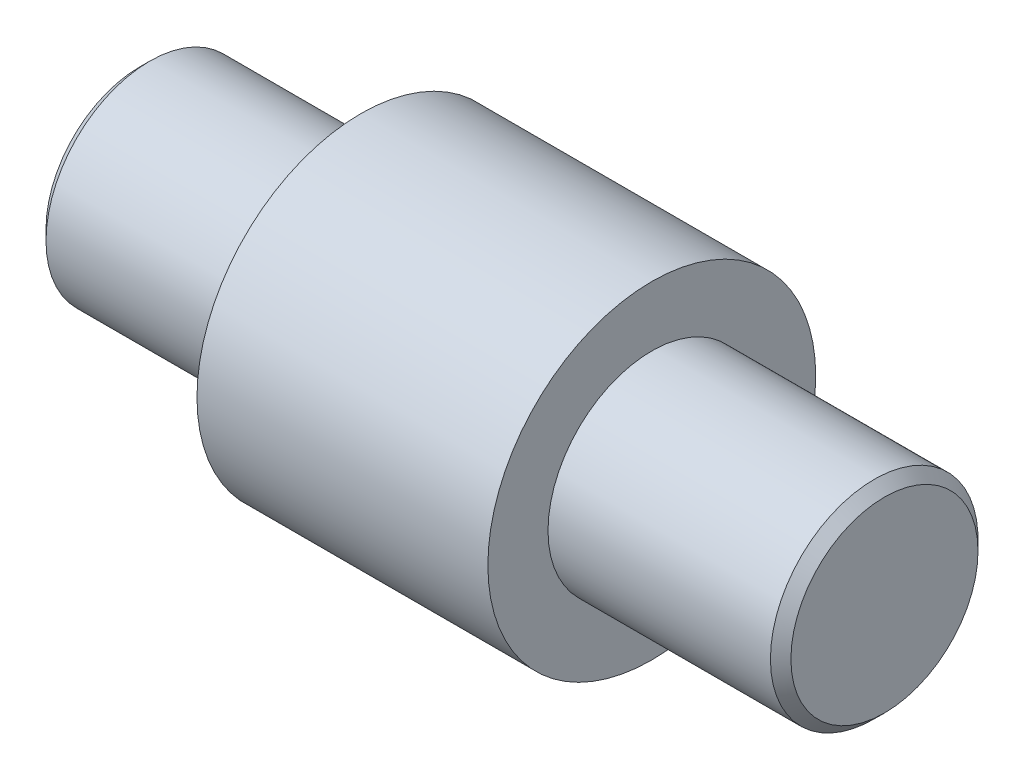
from build123d import *

# Parameters (mm, degrees)
CHANFREIN1_SIZE = 1


with BuildPart() as part:
    # Esquisse1 → R_volution1 (revolve)
    with BuildSketch(Plane.XY, mode=Mode.PRIVATE) as r_volution1_sk:
        Polygon((53.607042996, -119.985268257), (82, -119.985268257), (82, -125.85483319), (104.709234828, -125.85483319), (104.709234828, -135.985268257), (82, -135.985268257), (32, -135.985268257), (32, -125.85483319), (53.607042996, -125.85483319), align=None)
    revolve(r_volution1_sk.sketch.rotate(Axis((45.793202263, -135.985268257, 0), (1, 0, 0)), 90), axis=Axis((45.793202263, -135.985268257, 0), (1, 0, 0)))

    # Chanfrein1
    chanfrein1_edges = [part.edges().sort_by_distance(p)[0] for p in [
        (32, -135.985268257, -10.130435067),
        (104.709234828, -135.985268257, -10.130435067),
    ]]
    chamfer(chanfrein1_edges, length=CHANFREIN1_SIZE)


solid = part.part
